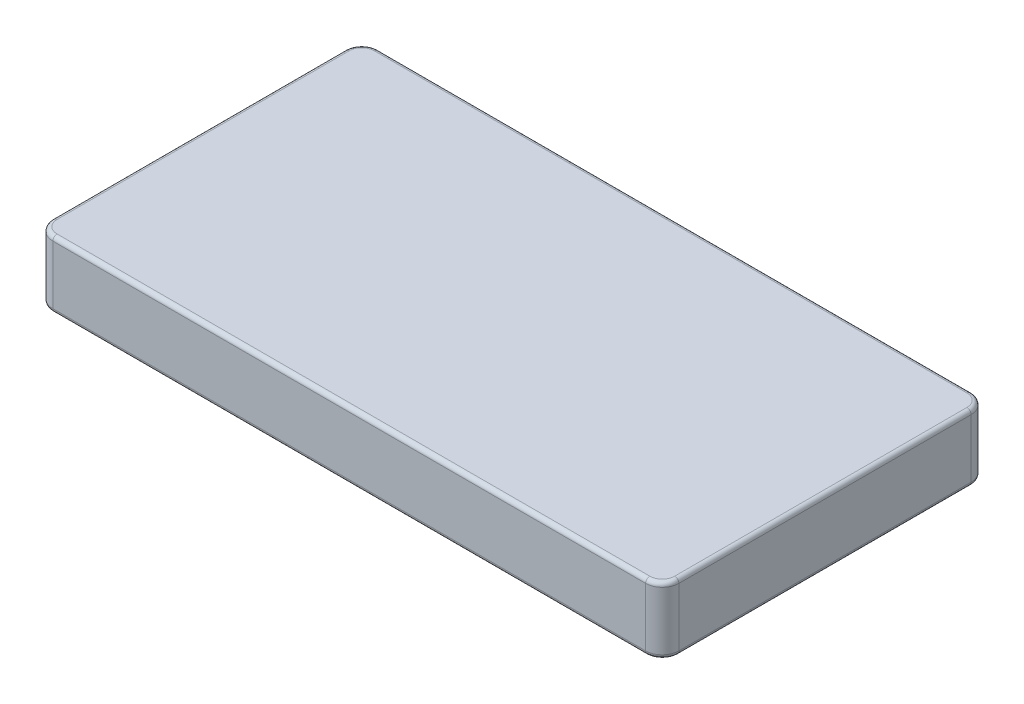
from build123d import *

# Parameters (mm, degrees)
BOSS_EXTRUDE1_DEPTH = 203.2
FILLET1_R           = 12.7


with BuildPart() as part:
    # Sketch1 → Boss-Extrude1 (new body)
    with BuildSketch(Plane(origin=(0, 0, 0), x_dir=(1, 0, 0), z_dir=(0, 1, 0))):
        with BuildLine():
            Line((-901.7, -495.3), (901.7, -495.3))
            ThreePointArc((901.7, -495.3), (937.621024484, -480.421024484), (952.5, -444.5))
            Line((952.5, -444.5), (952.5, 444.5))
            ThreePointArc((952.5, 444.5), (937.621024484, 480.421024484), (901.7, 495.3))
            Line((901.7, 495.3), (-901.7, 495.3))
            ThreePointArc((-901.7, 495.3), (-937.621024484, 480.421024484), (-952.5, 444.5))
            Line((-952.5, 444.5), (-952.5, -444.5))
            ThreePointArc((-952.5, -444.5), (-937.621024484, -480.421024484), (-901.7, -495.3))
        make_face()
    extrude(amount=BOSS_EXTRUDE1_DEPTH)

    # Fillet1
    fillet1_edges = [part.edges().sort_by_distance(p)[0] for p in [
        (-937.621024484, 203.2, -480.421024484),
        (0, 0, -495.3),
        (937.621024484, 0, -480.421024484),
        (-952.5, 203.2, 0),
        (-937.621024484, 203.2, 480.421024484),
        (0, 203.2, 495.3),
        (937.621024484, 203.2, 480.421024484),
        (952.5, 203.2, 0),
        (937.621024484, 203.2, -480.421024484),
        (0, 203.2, -495.3),
        (952.5, 0, 0),
        (937.621024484, 0, 480.421024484),
        (0, 0, 495.3),
        (-937.621024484, 0, 480.421024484),
        (-952.5, 0, 0),
        (-937.621024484, 0, -480.421024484),
    ]]
    fillet(fillet1_edges, radius=FILLET1_R)


solid = part.part
